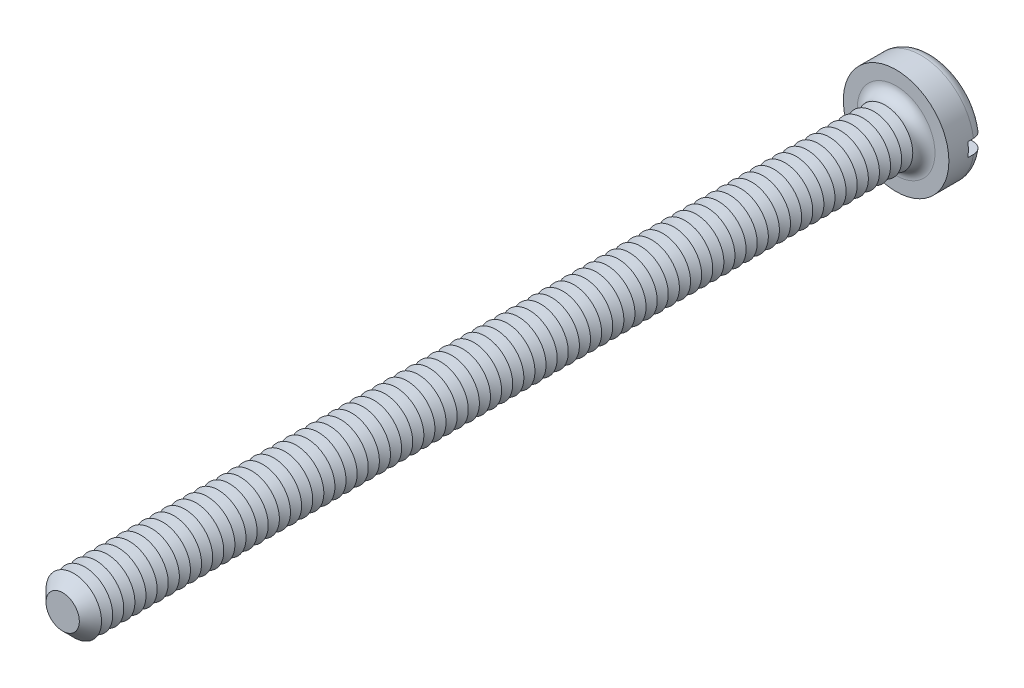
from build123d import *

# Parameters (mm, degrees)
SKETCH3_R           = 1.9
BOSS_EXTRUDE2_DEPTH = 1.3
SKETCH4_R           = 1
BOSS_EXTRUDE3_DEPTH = 30
FILLET1_R           = 0.4
CHAMFER1_SIZE       = 0.4
LPATTERN1_COUNT     = 73
LPATTERN1_PITCH     = 0.4
SKETCH8_W           = 3.8
SKETCH8_H           = 0.5
CUT_EXTRUDE1_DEPTH  = 0.6


with BuildPart() as part:
    # Sketch3 → Boss-Extrude2 (new body)
    with BuildSketch(Plane.XY):
        Circle(SKETCH3_R)
    extrude(amount=-BOSS_EXTRUDE2_DEPTH)

    # Sketch4 → Boss-Extrude3 (add)
    with BuildSketch(Plane.XY):
        Circle(SKETCH4_R)
    extrude(amount=BOSS_EXTRUDE3_DEPTH)

    # Fillet1
    fillet1_edges = [part.edges().sort_by_distance(p)[0] for p in [
        (-1.9, 0, -1.3),
        (-1, 0, 0),
    ]]
    fillet(fillet1_edges, radius=FILLET1_R)

    # Chamfer1
    chamfer1_edges = [part.edges().sort_by_distance(p)[0] for p in [
        (-1, 0, 30),
    ]]
    chamfer(chamfer1_edges, length=CHAMFER1_SIZE)

    # Sketch6 → Cut-Revolve1 (revolve, cut)
    with BuildSketch(Plane(origin=(0, 0, 0), x_dir=(0, 0, -1), z_dir=(1, 0, 0)), mode=Mode.PRIVATE) as cut_revolve1_sk:
        Polygon((-0.4, 1), (-0.6, 0.653589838), (-0.8, 1), align=None)
    cut_revolve1 = revolve(cut_revolve1_sk.sketch.rotate(Axis((0, 0, -1.694361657), (0, 0, 1)), 90), axis=Axis((0, 0, -1.694361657), (0, 0, 1)), mode=Mode.SUBTRACT)

    # LPattern1: Cut-Revolve1 ×73
    with Locations(*[(0, 0, i * LPATTERN1_PITCH) for i in range(1, LPATTERN1_COUNT)]):
        add(cut_revolve1, mode=Mode.SUBTRACT)

    # Sketch8 → Cut-Extrude1 (cut)
    with BuildSketch(Plane(origin=(0, 0, -1.3), x_dir=(-1, 0, 0), z_dir=(0, 0, -1))):
        Rectangle(SKETCH8_W, SKETCH8_H)
    extrude(amount=-CUT_EXTRUDE1_DEPTH, mode=Mode.SUBTRACT)


solid = part.part
